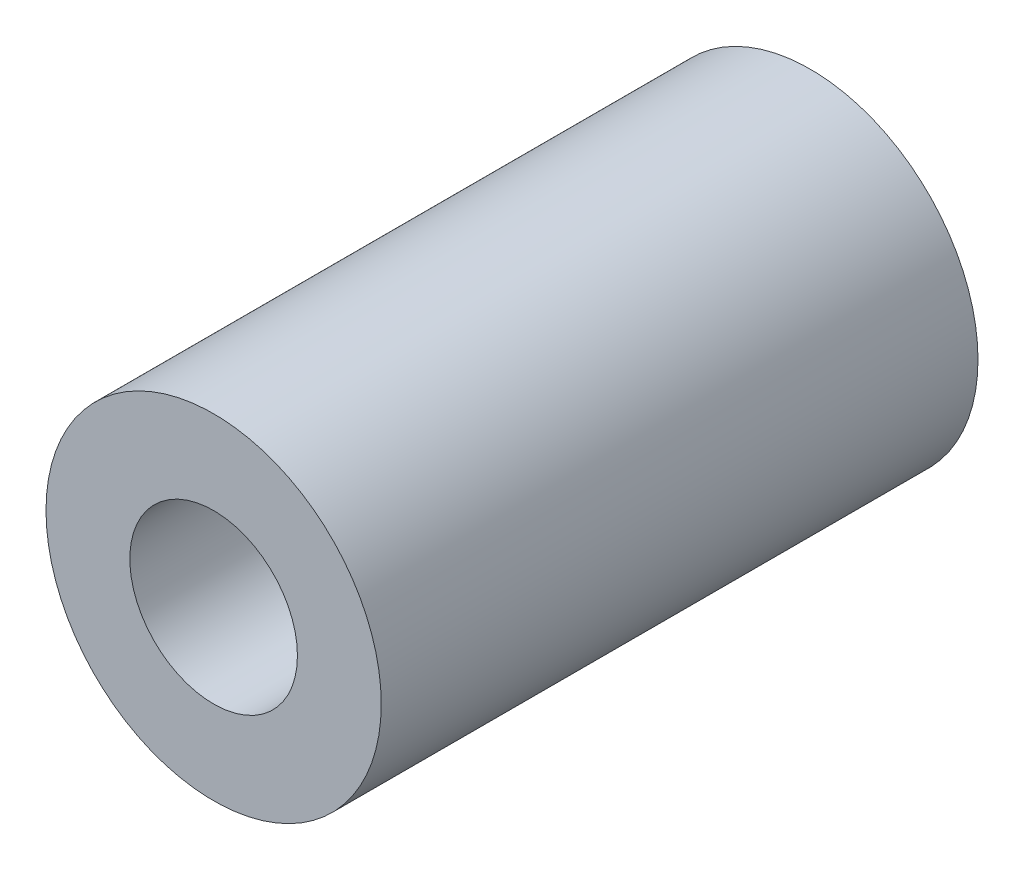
ISO-10303-21;
HEADER;
FILE_DESCRIPTION(('STEP AP214'),'2;1');
FILE_NAME('part.step','',(''),(''),'','','');
FILE_SCHEMA(('AUTOMOTIVE_DESIGN { 1 0 10303 214 1 1 1 1 }'));
ENDSEC;
DATA;
#1=APPLICATION_CONTEXT('core data for automotive mechanical design processes');
#2=APPLICATION_PROTOCOL_DEFINITION('international standard','automotive_design',2000,#1);
#3=PRODUCT_CONTEXT('',#1,'mechanical');
#4=PRODUCT('Part','Part','',(#3));
#5=PRODUCT_RELATED_PRODUCT_CATEGORY('part','',(#4));
#6=PRODUCT_DEFINITION_FORMATION('','',#4);
#7=PRODUCT_DEFINITION_CONTEXT('part definition',#1,'design');
#8=PRODUCT_DEFINITION('design','',#6,#7);
#9=PRODUCT_DEFINITION_SHAPE('','',#8);
#10=(LENGTH_UNIT() NAMED_UNIT(*) SI_UNIT(.MILLI.,.METRE.));
#11=(NAMED_UNIT(*) PLANE_ANGLE_UNIT() SI_UNIT($,.RADIAN.));
#12=(NAMED_UNIT(*) SI_UNIT($,.STERADIAN.) SOLID_ANGLE_UNIT());
#13=UNCERTAINTY_MEASURE_WITH_UNIT(LENGTH_MEASURE(1.E-05),#10,'distance_accuracy_value','');
#14=(GEOMETRIC_REPRESENTATION_CONTEXT(3) GLOBAL_UNCERTAINTY_ASSIGNED_CONTEXT((#13)) GLOBAL_UNIT_ASSIGNED_CONTEXT((#10,
#11,#12)) REPRESENTATION_CONTEXT('',''));
#15=CARTESIAN_POINT('',(0.,0.,0.));
#16=DIRECTION('',(0.,0.,1.));
#17=DIRECTION('',(1.,0.,0.));
#18=AXIS2_PLACEMENT_3D('',#15,#16,#17);
#19=CARTESIAN_POINT('',(0.,0.,89.));
#20=DIRECTION('',(0.,0.,1.));
#21=DIRECTION('',(1.,0.,0.));
#22=AXIS2_PLACEMENT_3D('',#19,#20,#21);
#23=PLANE('',#22);
#24=CARTESIAN_POINT('',(0.,0.,89.));
#25=DIRECTION('',(0.,0.,1.));
#26=DIRECTION('',(1.,0.,0.));
#27=AXIS2_PLACEMENT_3D('',#24,#25,#26);
#28=CIRCLE('',#27,25.);
#29=CARTESIAN_POINT('',(25.,0.,89.));
#30=VERTEX_POINT('',#29);
#31=EDGE_CURVE('E9',#30,#30,#28,.T.);
#32=ORIENTED_EDGE('',*,*,#31,.T.);
#33=EDGE_LOOP('',(#32));
#34=FACE_BOUND('',#33,.T.);
#35=CARTESIAN_POINT('',(0.,0.,89.));
#36=DIRECTION('',(0.,0.,1.));
#37=DIRECTION('',(1.,0.,0.));
#38=AXIS2_PLACEMENT_3D('',#35,#36,#37);
#39=CIRCLE('',#38,12.5);
#40=CARTESIAN_POINT('',(12.5,0.,89.));
#41=VERTEX_POINT('',#40);
#42=EDGE_CURVE('E25',#41,#41,#39,.T.);
#43=ORIENTED_EDGE('',*,*,#42,.F.);
#44=EDGE_LOOP('',(#43));
#45=FACE_BOUND('',#44,.T.);
#46=ADVANCED_FACE('F14',(#34,#45),#23,.T.);
#47=CARTESIAN_POINT('',(0.,0.,0.));
#48=DIRECTION('',(0.,0.,1.));
#49=DIRECTION('',(1.,0.,0.));
#50=AXIS2_PLACEMENT_3D('',#47,#48,#49);
#51=PLANE('',#50);
#52=CARTESIAN_POINT('',(0.,0.,0.));
#53=DIRECTION('',(0.,0.,1.));
#54=DIRECTION('',(1.,0.,0.));
#55=AXIS2_PLACEMENT_3D('',#52,#53,#54);
#56=CIRCLE('',#55,25.);
#57=CARTESIAN_POINT('',(25.,0.,0.));
#58=VERTEX_POINT('',#57);
#59=EDGE_CURVE('E18',#58,#58,#56,.T.);
#60=ORIENTED_EDGE('',*,*,#59,.F.);
#61=EDGE_LOOP('',(#60));
#62=FACE_BOUND('',#61,.T.);
#63=CARTESIAN_POINT('',(0.,0.,0.));
#64=DIRECTION('',(0.,0.,1.));
#65=DIRECTION('',(1.,0.,0.));
#66=AXIS2_PLACEMENT_3D('',#63,#64,#65);
#67=CIRCLE('',#66,12.5);
#68=CARTESIAN_POINT('',(12.5,0.,0.));
#69=VERTEX_POINT('',#68);
#70=EDGE_CURVE('E27',#69,#69,#67,.T.);
#71=ORIENTED_EDGE('',*,*,#70,.T.);
#72=EDGE_LOOP('',(#71));
#73=FACE_BOUND('',#72,.T.);
#74=ADVANCED_FACE('F37',(#62,#73),#51,.F.);
#75=CARTESIAN_POINT('',(0.,0.,89.));
#76=DIRECTION('',(0.,0.,-1.));
#77=DIRECTION('',(-1.,0.,0.));
#78=AXIS2_PLACEMENT_3D('',#75,#76,#77);
#79=CYLINDRICAL_SURFACE('',#78,25.);
#80=ORIENTED_EDGE('',*,*,#31,.F.);
#81=EDGE_LOOP('',(#80));
#82=FACE_BOUND('',#81,.T.);
#83=ORIENTED_EDGE('',*,*,#59,.T.);
#84=EDGE_LOOP('',(#83));
#85=FACE_BOUND('',#84,.T.);
#86=ADVANCED_FACE('F16',(#82,#85),#79,.T.);
#87=CARTESIAN_POINT('',(0.,0.,89.));
#88=DIRECTION('',(0.,0.,-1.));
#89=DIRECTION('',(-1.,0.,0.));
#90=AXIS2_PLACEMENT_3D('',#87,#88,#89);
#91=CYLINDRICAL_SURFACE('',#90,12.5);
#92=ORIENTED_EDGE('',*,*,#42,.T.);
#93=EDGE_LOOP('',(#92));
#94=FACE_BOUND('',#93,.T.);
#95=ORIENTED_EDGE('',*,*,#70,.F.);
#96=EDGE_LOOP('',(#95));
#97=FACE_BOUND('',#96,.T.);
#98=ADVANCED_FACE('F33',(#94,#97),#91,.F.);
#99=CLOSED_SHELL('',(#46,#74,#86,#98));
#100=MANIFOLD_SOLID_BREP('B1',#99);
#101=ADVANCED_BREP_SHAPE_REPRESENTATION('',(#18,#100),#14);
#102=SHAPE_DEFINITION_REPRESENTATION(#9,#101);
ENDSEC;
END-ISO-10303-21;
